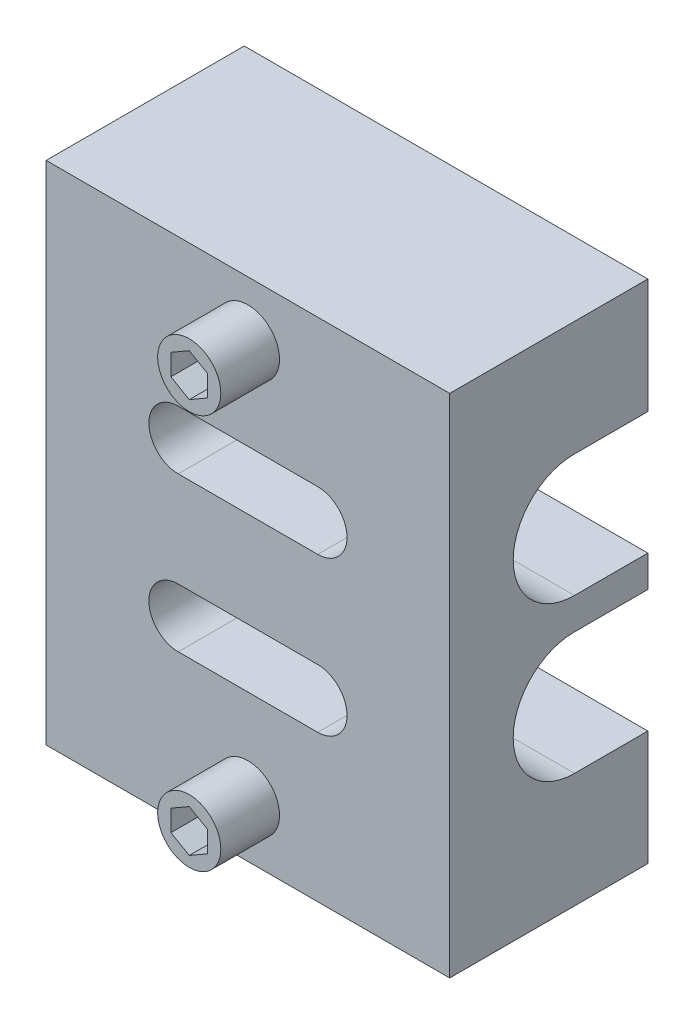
from build123d import *

# Parameters (mm, degrees)
SKETCH1_W          = 13.97
SKETCH1_H          = 17.526
EXTRUDE1_DEPTH     = 6.858
CUT_EXTRUDE2_DEPTH = 6.858
SKETCH4_R          = 1.0922
EXTRUDE2_DEPTH     = 2.032
CUT_EXTRUDE3_DEPTH = 1.016
CUT_EXTRUDE5_DEPTH = 19.734544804


with BuildPart() as part:
    # Sketch1 → Extrude1 (new body)
    with BuildSketch(Plane.XY):
        Rectangle(SKETCH1_W, SKETCH1_H)
    extrude(amount=EXTRUDE1_DEPTH)

    # Sketch3 → Cut-Extrude2 (cut)
    with BuildSketch(Plane.XY.offset(6.858)):
        with BuildLine():
            Line((-2.413, -3.683), (2.413, -3.683))
            ThreePointArc((2.413, -3.683), (3.429, -2.667), (2.413, -1.651))
            Line((2.413, -1.651), (-2.413, -1.651))
            ThreePointArc((-2.413, -1.651), (-3.429, -2.667), (-2.413, -3.683))
        make_face()
        with BuildLine():
            Line((2.413, 3.683), (-2.413, 3.683))
            ThreePointArc((-2.413, 3.683), (-3.429, 2.667), (-2.413, 1.651))
            Line((-2.413, 1.651), (2.413, 1.651))
            ThreePointArc((2.413, 1.651), (3.429, 2.667), (2.413, 3.683))
        make_face()
    extrude(amount=-CUT_EXTRUDE2_DEPTH, mode=Mode.SUBTRACT)

    # Sketch4 → Extrude2 (add)
    with BuildSketch(Plane.XY.offset(6.858)):
        with Locations((0, 6.8326)):
            Circle(SKETCH4_R)
        with Locations((0, -6.8326)):
            Circle(SKETCH4_R)
    extrude(amount=EXTRUDE2_DEPTH)

    # Sketch6 → Cut-Extrude3 (cut)
    with BuildSketch(Plane.XY.offset(8.89)):
        Polygon((0, 7.565834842), (-0.635, 7.199217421), (-0.635, 6.465982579), (0, 6.099365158), (0.635, 6.465982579), (0.635, 7.199217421), align=None)
        Polygon((0, -6.099365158), (-0.635, -6.465982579), (-0.635, -7.199217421), (0, -7.565834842), (0.635, -7.199217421), (0.635, -6.465982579), align=None)
    extrude(amount=-CUT_EXTRUDE3_DEPTH, mode=Mode.SUBTRACT)

    # Sketch8 → Cut-Extrude5 (cut, through all)
    with BuildSketch(Plane(origin=(6.985, 0, 0), x_dir=(0, 0, -1), z_dir=(1, 0, 0))):
        with BuildLine():
            Line((-2.54, 0.5461), (0, 0.5461))
            Line((0, 0.5461), (0, 4.7879))
            Line((0, 4.7879), (-2.54, 4.7879))
            ThreePointArc((-2.54, 4.7879), (-4.6609, 2.667), (-2.54, 0.5461))
        make_face()
        with BuildLine():
            Line((-2.54, -4.7879), (0, -4.7879))
            Line((0, -4.7879), (0, -0.5461))
            Line((0, -0.5461), (-2.54, -0.5461))
            ThreePointArc((-2.54, -0.5461), (-4.6609, -2.667), (-2.54, -4.7879))
        make_face()
    extrude(amount=-CUT_EXTRUDE5_DEPTH, mode=Mode.SUBTRACT)


solid = part.part
